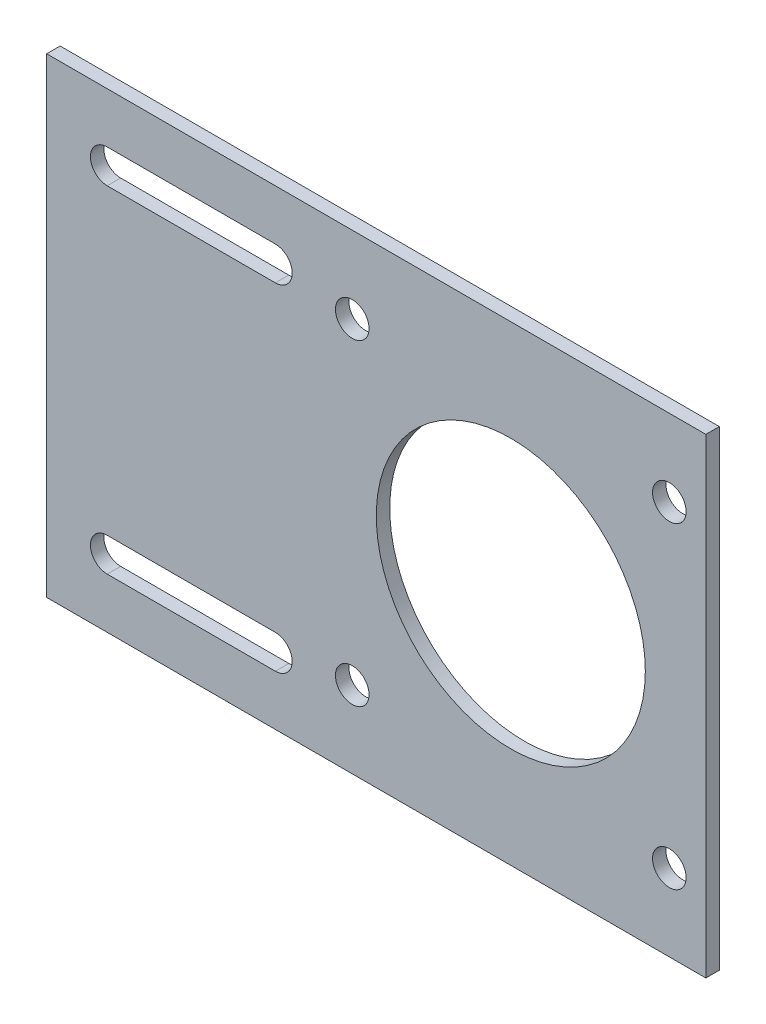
from build123d import *

# Parameters (mm, degrees)
CROQUIS1_W                    = 98
CROQUIS1_H                    = 70
CROQUIS1_R                    = 20
EXTRUIR1_DEPTH                = 2
DI_METRO_DE_TALADRO_5_0_5_1_D = 5


with BuildPart() as part:
    # Croquis1 → Extruir1 (new body)
    with BuildSketch(Plane.XY):
        with Locations((-20, 0)):
            Rectangle(CROQUIS1_W, CROQUIS1_H)
        Circle(CROQUIS1_R, mode=Mode.SUBTRACT)
        with BuildLine():
            Line((-60, 27.5), (-35, 27.5))
            ThreePointArc((-35, 27.5), (-32.5, 25), (-35, 22.5))
            Line((-35, 22.5), (-60, 22.5))
            ThreePointArc((-60, 22.5), (-62.5, 25), (-60, 27.5))
        make_face(mode=Mode.SUBTRACT)
        with BuildLine():
            Line((-60, -22.5), (-35, -22.5))
            ThreePointArc((-35, -22.5), (-32.5, -25), (-35, -27.5))
            Line((-35, -27.5), (-60, -27.5))
            ThreePointArc((-60, -27.5), (-62.5, -25), (-60, -22.5))
        make_face(mode=Mode.SUBTRACT)
    extrude(amount=EXTRUIR1_DEPTH)

    # Di_metro de taladro _5.0 _5_1 (through all)
    with Locations(Plane.XY.offset(2)):
        with Locations((23.57, 23.57), (-23.57, 23.57), (23.57, -23.57), (-23.57, -23.57)):
            Hole(DI_METRO_DE_TALADRO_5_0_5_1_D / 2)


solid = part.part
